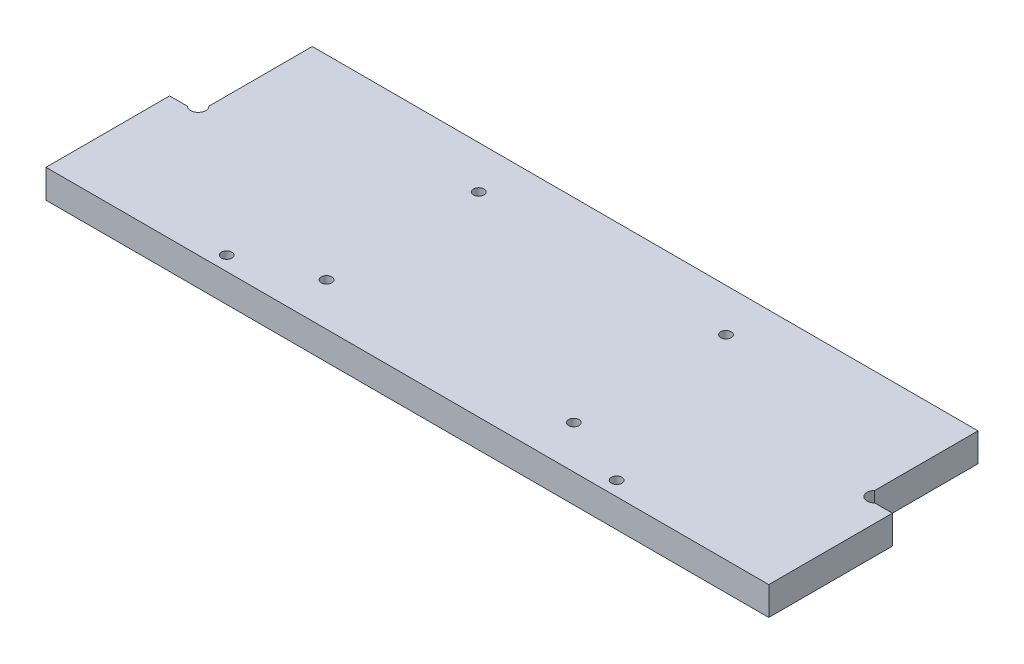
ISO-10303-21;
HEADER;
FILE_DESCRIPTION(('STEP AP214'),'2;1');
FILE_NAME('part.step','',(''),(''),'','','');
FILE_SCHEMA(('AUTOMOTIVE_DESIGN { 1 0 10303 214 1 1 1 1 }'));
ENDSEC;
DATA;
#1=APPLICATION_CONTEXT('core data for automotive mechanical design processes');
#2=APPLICATION_PROTOCOL_DEFINITION('international standard','automotive_design',2000,#1);
#3=PRODUCT_CONTEXT('',#1,'mechanical');
#4=PRODUCT('Part','Part','',(#3));
#5=PRODUCT_RELATED_PRODUCT_CATEGORY('part','',(#4));
#6=PRODUCT_DEFINITION_FORMATION('','',#4);
#7=PRODUCT_DEFINITION_CONTEXT('part definition',#1,'design');
#8=PRODUCT_DEFINITION('design','',#6,#7);
#9=PRODUCT_DEFINITION_SHAPE('','',#8);
#10=(LENGTH_UNIT() NAMED_UNIT(*) SI_UNIT(.MILLI.,.METRE.));
#11=(NAMED_UNIT(*) PLANE_ANGLE_UNIT() SI_UNIT($,.RADIAN.));
#12=(NAMED_UNIT(*) SI_UNIT($,.STERADIAN.) SOLID_ANGLE_UNIT());
#13=UNCERTAINTY_MEASURE_WITH_UNIT(LENGTH_MEASURE(1.E-05),#10,'distance_accuracy_value','');
#14=(GEOMETRIC_REPRESENTATION_CONTEXT(3) GLOBAL_UNCERTAINTY_ASSIGNED_CONTEXT((#13)) GLOBAL_UNIT_ASSIGNED_CONTEXT((#10,
#11,#12)) REPRESENTATION_CONTEXT('',''));
#15=CARTESIAN_POINT('',(0.,0.,0.));
#16=DIRECTION('',(0.,0.,1.));
#17=DIRECTION('',(1.,0.,0.));
#18=AXIS2_PLACEMENT_3D('',#15,#16,#17);
#19=CARTESIAN_POINT('',(147.131370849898,6.,-27.1313708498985));
#20=DIRECTION('',(0.,1.,0.));
#21=DIRECTION('',(0.,0.,1.));
#22=AXIS2_PLACEMENT_3D('',#19,#20,#21);
#23=PLANE('',#22);
#24=CARTESIAN_POINT('',(102.,6.,-41.));
#25=DIRECTION('',(0.,1.,0.));
#26=DIRECTION('',(0.,0.,1.));
#27=AXIS2_PLACEMENT_3D('',#24,#25,#26);
#28=CIRCLE('',#27,1.09999999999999);
#29=CARTESIAN_POINT('',(102.,6.,-39.9));
#30=VERTEX_POINT('',#29);
#31=EDGE_CURVE('E230',#30,#30,#28,.T.);
#32=ORIENTED_EDGE('',*,*,#31,.F.);
#33=EDGE_LOOP('',(#32));
#34=FACE_BOUND('',#33,.T.);
#35=CARTESIAN_POINT('',(50.,6.,-9.00000000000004));
#36=DIRECTION('',(0.,1.,0.));
#37=DIRECTION('',(0.,0.,1.));
#38=AXIS2_PLACEMENT_3D('',#35,#36,#37);
#39=CIRCLE('',#38,1.1);
#40=CARTESIAN_POINT('',(50.,6.,-7.90000000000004));
#41=VERTEX_POINT('',#40);
#42=EDGE_CURVE('E218',#41,#41,#39,.T.);
#43=ORIENTED_EDGE('',*,*,#42,.F.);
#44=EDGE_LOOP('',(#43));
#45=FACE_BOUND('',#44,.T.);
#46=CARTESIAN_POINT('',(117.,6.,-3.));
#47=DIRECTION('',(0.,1.,0.));
#48=DIRECTION('',(0.,0.,1.));
#49=AXIS2_PLACEMENT_3D('',#46,#47,#48);
#50=CIRCLE('',#49,1.10000000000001);
#51=CARTESIAN_POINT('',(117.,6.,-1.89999999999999));
#52=VERTEX_POINT('',#51);
#53=EDGE_CURVE('E146',#52,#52,#50,.T.);
#54=ORIENTED_EDGE('',*,*,#53,.F.);
#55=EDGE_LOOP('',(#54));
#56=FACE_BOUND('',#55,.T.);
#57=CARTESIAN_POINT('',(147.131370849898,6.,-27.1313708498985));
#58=DIRECTION('',(0.,-1.,0.));
#59=DIRECTION('',(0.,0.,1.));
#60=AXIS2_PLACEMENT_3D('',#57,#58,#59);
#61=CIRCLE('',#60,1.59999999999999);
#62=CARTESIAN_POINT('',(148.262741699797,6.,-26.));
#63=VERTEX_POINT('',#62);
#64=CARTESIAN_POINT('',(146.,6.,-28.2627416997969));
#65=VERTEX_POINT('',#64);
#66=EDGE_CURVE('E161',#63,#65,#61,.T.);
#67=ORIENTED_EDGE('',*,*,#66,.T.);
#68=DIRECTION('',(0.,0.,-1.));
#69=VECTOR('',#68,1.);
#70=CARTESIAN_POINT('',(146.,6.,-28.2627416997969));
#71=LINE('',#70,#69);
#72=CARTESIAN_POINT('',(146.,6.,-50.));
#73=VERTEX_POINT('',#72);
#74=EDGE_CURVE('E99',#65,#73,#71,.T.);
#75=ORIENTED_EDGE('',*,*,#74,.T.);
#76=DIRECTION('',(-1.,0.,0.));
#77=VECTOR('',#76,1.);
#78=CARTESIAN_POINT('',(6.00000000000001,6.,-50.));
#79=LINE('',#78,#77);
#80=CARTESIAN_POINT('',(6.00000000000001,6.,-50.));
#81=VERTEX_POINT('',#80);
#82=EDGE_CURVE('E182',#73,#81,#79,.T.);
#83=ORIENTED_EDGE('',*,*,#82,.T.);
#84=DIRECTION('',(0.,0.,1.));
#85=VECTOR('',#84,1.);
#86=CARTESIAN_POINT('',(6.00000000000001,6.,-28.2627416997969));
#87=LINE('',#86,#85);
#88=CARTESIAN_POINT('',(6.00000000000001,6.,-28.2627416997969));
#89=VERTEX_POINT('',#88);
#90=EDGE_CURVE('E201',#81,#89,#87,.T.);
#91=ORIENTED_EDGE('',*,*,#90,.T.);
#92=CARTESIAN_POINT('',(4.86862915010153,6.,-27.1313708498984));
#93=DIRECTION('',(0.,-1.,0.));
#94=DIRECTION('',(0.,0.,-1.));
#95=AXIS2_PLACEMENT_3D('',#92,#93,#94);
#96=CIRCLE('',#95,1.6);
#97=CARTESIAN_POINT('',(3.73725830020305,6.,-26.));
#98=VERTEX_POINT('',#97);
#99=EDGE_CURVE('E198',#89,#98,#96,.T.);
#100=ORIENTED_EDGE('',*,*,#99,.T.);
#101=DIRECTION('',(-1.,0.,0.));
#102=VECTOR('',#101,1.);
#103=CARTESIAN_POINT('',(3.73725830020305,6.,-26.));
#104=LINE('',#103,#102);
#105=CARTESIAN_POINT('',(0.,6.,-26.));
#106=VERTEX_POINT('',#105);
#107=EDGE_CURVE('E200',#98,#106,#104,.T.);
#108=ORIENTED_EDGE('',*,*,#107,.T.);
#109=DIRECTION('',(0.,0.,1.));
#110=VECTOR('',#109,1.);
#111=CARTESIAN_POINT('',(0.,6.,-26.));
#112=LINE('',#111,#110);
#113=CARTESIAN_POINT('',(0.,6.,0.));
#114=VERTEX_POINT('',#113);
#115=EDGE_CURVE('E124',#106,#114,#112,.T.);
#116=ORIENTED_EDGE('',*,*,#115,.T.);
#117=DIRECTION('',(1.,0.,0.));
#118=VECTOR('',#117,1.);
#119=CARTESIAN_POINT('',(0.,6.,0.));
#120=LINE('',#119,#118);
#121=CARTESIAN_POINT('',(152.,6.,0.));
#122=VERTEX_POINT('',#121);
#123=EDGE_CURVE('E118',#114,#122,#120,.T.);
#124=ORIENTED_EDGE('',*,*,#123,.T.);
#125=DIRECTION('',(0.,0.,-1.));
#126=VECTOR('',#125,1.);
#127=CARTESIAN_POINT('',(152.,6.,-26.));
#128=LINE('',#127,#126);
#129=CARTESIAN_POINT('',(152.,6.,-26.));
#130=VERTEX_POINT('',#129);
#131=EDGE_CURVE('E122',#122,#130,#128,.T.);
#132=ORIENTED_EDGE('',*,*,#131,.T.);
#133=DIRECTION('',(-1.,0.,0.));
#134=VECTOR('',#133,1.);
#135=CARTESIAN_POINT('',(148.262741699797,6.,-26.));
#136=LINE('',#135,#134);
#137=EDGE_CURVE('E50',#130,#63,#136,.T.);
#138=ORIENTED_EDGE('',*,*,#137,.T.);
#139=EDGE_LOOP('',(#67,#75,#83,#91,#100,#108,#116,#124,#132,#138));
#140=FACE_BOUND('',#139,.T.);
#141=CARTESIAN_POINT('',(35.,6.,-2.99999999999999));
#142=DIRECTION('',(0.,1.,0.));
#143=DIRECTION('',(0.,0.,-1.));
#144=AXIS2_PLACEMENT_3D('',#141,#142,#143);
#145=CIRCLE('',#144,1.10000000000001);
#146=CARTESIAN_POINT('',(35.,6.,-4.09999999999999));
#147=VERTEX_POINT('',#146);
#148=EDGE_CURVE('E212',#147,#147,#145,.T.);
#149=ORIENTED_EDGE('',*,*,#148,.F.);
#150=EDGE_LOOP('',(#149));
#151=FACE_BOUND('',#150,.T.);
#152=CARTESIAN_POINT('',(102.,6.,-9.00000000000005));
#153=DIRECTION('',(0.,1.,0.));
#154=DIRECTION('',(0.,0.,-1.));
#155=AXIS2_PLACEMENT_3D('',#152,#153,#154);
#156=CIRCLE('',#155,1.09999999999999);
#157=CARTESIAN_POINT('',(102.,6.,-10.1));
#158=VERTEX_POINT('',#157);
#159=EDGE_CURVE('E224',#158,#158,#156,.T.);
#160=ORIENTED_EDGE('',*,*,#159,.F.);
#161=EDGE_LOOP('',(#160));
#162=FACE_BOUND('',#161,.T.);
#163=CARTESIAN_POINT('',(50.,6.,-41.));
#164=DIRECTION('',(0.,1.,0.));
#165=DIRECTION('',(0.,0.,-1.));
#166=AXIS2_PLACEMENT_3D('',#163,#164,#165);
#167=CIRCLE('',#166,1.1);
#168=CARTESIAN_POINT('',(50.,6.,-42.1));
#169=VERTEX_POINT('',#168);
#170=EDGE_CURVE('E236',#169,#169,#167,.T.);
#171=ORIENTED_EDGE('',*,*,#170,.F.);
#172=EDGE_LOOP('',(#171));
#173=FACE_BOUND('',#172,.T.);
#174=ADVANCED_FACE('F33',(#34,#45,#56,#140,#151,#162,#173),#23,.T.);
#175=CARTESIAN_POINT('',(147.131370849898,0.,-27.1313708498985));
#176=DIRECTION('',(0.,1.,0.));
#177=DIRECTION('',(0.,0.,1.));
#178=AXIS2_PLACEMENT_3D('',#175,#176,#177);
#179=PLANE('',#178);
#180=CARTESIAN_POINT('',(147.131370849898,0.,-27.1313708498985));
#181=DIRECTION('',(0.,-1.,0.));
#182=DIRECTION('',(0.,0.,1.));
#183=AXIS2_PLACEMENT_3D('',#180,#181,#182);
#184=CIRCLE('',#183,1.59999999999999);
#185=CARTESIAN_POINT('',(148.262741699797,0.,-26.));
#186=VERTEX_POINT('',#185);
#187=CARTESIAN_POINT('',(146.,0.,-28.2627416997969));
#188=VERTEX_POINT('',#187);
#189=EDGE_CURVE('E142',#186,#188,#184,.T.);
#190=ORIENTED_EDGE('',*,*,#189,.F.);
#191=DIRECTION('',(-1.,0.,0.));
#192=VECTOR('',#191,1.);
#193=CARTESIAN_POINT('',(148.262741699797,0.,-26.));
#194=LINE('',#193,#192);
#195=CARTESIAN_POINT('',(152.,0.,-26.));
#196=VERTEX_POINT('',#195);
#197=EDGE_CURVE('E91',#196,#186,#194,.T.);
#198=ORIENTED_EDGE('',*,*,#197,.F.);
#199=DIRECTION('',(0.,0.,-1.));
#200=VECTOR('',#199,1.);
#201=CARTESIAN_POINT('',(152.,0.,-26.));
#202=LINE('',#201,#200);
#203=CARTESIAN_POINT('',(152.,0.,0.));
#204=VERTEX_POINT('',#203);
#205=EDGE_CURVE('E85',#204,#196,#202,.T.);
#206=ORIENTED_EDGE('',*,*,#205,.F.);
#207=DIRECTION('',(1.,0.,0.));
#208=VECTOR('',#207,1.);
#209=CARTESIAN_POINT('',(0.,0.,0.));
#210=LINE('',#209,#208);
#211=CARTESIAN_POINT('',(0.,0.,0.));
#212=VERTEX_POINT('',#211);
#213=EDGE_CURVE('E132',#212,#204,#210,.T.);
#214=ORIENTED_EDGE('',*,*,#213,.F.);
#215=DIRECTION('',(0.,0.,1.));
#216=VECTOR('',#215,1.);
#217=CARTESIAN_POINT('',(0.,0.,-26.));
#218=LINE('',#217,#216);
#219=CARTESIAN_POINT('',(0.,0.,-26.));
#220=VERTEX_POINT('',#219);
#221=EDGE_CURVE('E156',#220,#212,#218,.T.);
#222=ORIENTED_EDGE('',*,*,#221,.F.);
#223=DIRECTION('',(-1.,0.,0.));
#224=VECTOR('',#223,1.);
#225=CARTESIAN_POINT('',(3.73725830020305,0.,-26.));
#226=LINE('',#225,#224);
#227=CARTESIAN_POINT('',(3.73725830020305,0.,-26.));
#228=VERTEX_POINT('',#227);
#229=EDGE_CURVE('E154',#228,#220,#226,.T.);
#230=ORIENTED_EDGE('',*,*,#229,.F.);
#231=CARTESIAN_POINT('',(4.86862915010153,0.,-27.1313708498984));
#232=DIRECTION('',(0.,-1.,0.));
#233=DIRECTION('',(0.,0.,-1.));
#234=AXIS2_PLACEMENT_3D('',#231,#232,#233);
#235=CIRCLE('',#234,1.6);
#236=CARTESIAN_POINT('',(6.00000000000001,0.,-28.2627416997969));
#237=VERTEX_POINT('',#236);
#238=EDGE_CURVE('E152',#237,#228,#235,.T.);
#239=ORIENTED_EDGE('',*,*,#238,.F.);
#240=DIRECTION('',(0.,0.,1.));
#241=VECTOR('',#240,1.);
#242=CARTESIAN_POINT('',(6.00000000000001,0.,-28.2627416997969));
#243=LINE('',#242,#241);
#244=CARTESIAN_POINT('',(6.00000000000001,0.,-50.));
#245=VERTEX_POINT('',#244);
#246=EDGE_CURVE('E150',#245,#237,#243,.T.);
#247=ORIENTED_EDGE('',*,*,#246,.F.);
#248=DIRECTION('',(-1.,0.,0.));
#249=VECTOR('',#248,1.);
#250=CARTESIAN_POINT('',(6.00000000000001,0.,-50.));
#251=LINE('',#250,#249);
#252=CARTESIAN_POINT('',(146.,0.,-50.));
#253=VERTEX_POINT('',#252);
#254=EDGE_CURVE('E148',#253,#245,#251,.T.);
#255=ORIENTED_EDGE('',*,*,#254,.F.);
#256=DIRECTION('',(0.,0.,-1.));
#257=VECTOR('',#256,1.);
#258=CARTESIAN_POINT('',(146.,0.,-28.2627416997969));
#259=LINE('',#258,#257);
#260=EDGE_CURVE('E145',#188,#253,#259,.T.);
#261=ORIENTED_EDGE('',*,*,#260,.F.);
#262=EDGE_LOOP('',(#190,#198,#206,#214,#222,#230,#239,#247,#255,#261));
#263=FACE_BOUND('',#262,.T.);
#264=CARTESIAN_POINT('',(117.,0.,-3.));
#265=DIRECTION('',(0.,1.,0.));
#266=DIRECTION('',(0.,0.,1.));
#267=AXIS2_PLACEMENT_3D('',#264,#265,#266);
#268=CIRCLE('',#267,1.10000000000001);
#269=CARTESIAN_POINT('',(117.,0.,-1.89999999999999));
#270=VERTEX_POINT('',#269);
#271=EDGE_CURVE('E209',#270,#270,#268,.T.);
#272=ORIENTED_EDGE('',*,*,#271,.T.);
#273=EDGE_LOOP('',(#272));
#274=FACE_BOUND('',#273,.T.);
#275=CARTESIAN_POINT('',(35.,0.,-2.99999999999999));
#276=DIRECTION('',(0.,1.,0.));
#277=DIRECTION('',(0.,0.,-1.));
#278=AXIS2_PLACEMENT_3D('',#275,#276,#277);
#279=CIRCLE('',#278,1.10000000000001);
#280=CARTESIAN_POINT('',(35.,0.,-4.09999999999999));
#281=VERTEX_POINT('',#280);
#282=EDGE_CURVE('E215',#281,#281,#279,.T.);
#283=ORIENTED_EDGE('',*,*,#282,.T.);
#284=EDGE_LOOP('',(#283));
#285=FACE_BOUND('',#284,.T.);
#286=CARTESIAN_POINT('',(50.,0.,-9.00000000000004));
#287=DIRECTION('',(0.,1.,0.));
#288=DIRECTION('',(0.,0.,1.));
#289=AXIS2_PLACEMENT_3D('',#286,#287,#288);
#290=CIRCLE('',#289,1.1);
#291=CARTESIAN_POINT('',(50.,0.,-7.90000000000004));
#292=VERTEX_POINT('',#291);
#293=EDGE_CURVE('E221',#292,#292,#290,.T.);
#294=ORIENTED_EDGE('',*,*,#293,.T.);
#295=EDGE_LOOP('',(#294));
#296=FACE_BOUND('',#295,.T.);
#297=CARTESIAN_POINT('',(102.,0.,-9.00000000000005));
#298=DIRECTION('',(0.,1.,0.));
#299=DIRECTION('',(0.,0.,-1.));
#300=AXIS2_PLACEMENT_3D('',#297,#298,#299);
#301=CIRCLE('',#300,1.09999999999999);
#302=CARTESIAN_POINT('',(102.,0.,-10.1));
#303=VERTEX_POINT('',#302);
#304=EDGE_CURVE('E227',#303,#303,#301,.T.);
#305=ORIENTED_EDGE('',*,*,#304,.T.);
#306=EDGE_LOOP('',(#305));
#307=FACE_BOUND('',#306,.T.);
#308=CARTESIAN_POINT('',(102.,0.,-41.));
#309=DIRECTION('',(0.,1.,0.));
#310=DIRECTION('',(0.,0.,1.));
#311=AXIS2_PLACEMENT_3D('',#308,#309,#310);
#312=CIRCLE('',#311,1.09999999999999);
#313=CARTESIAN_POINT('',(102.,0.,-39.9));
#314=VERTEX_POINT('',#313);
#315=EDGE_CURVE('E233',#314,#314,#312,.T.);
#316=ORIENTED_EDGE('',*,*,#315,.T.);
#317=EDGE_LOOP('',(#316));
#318=FACE_BOUND('',#317,.T.);
#319=CARTESIAN_POINT('',(50.,0.,-41.));
#320=DIRECTION('',(0.,1.,0.));
#321=DIRECTION('',(0.,0.,-1.));
#322=AXIS2_PLACEMENT_3D('',#319,#320,#321);
#323=CIRCLE('',#322,1.1);
#324=CARTESIAN_POINT('',(50.,0.,-42.1));
#325=VERTEX_POINT('',#324);
#326=EDGE_CURVE('E239',#325,#325,#323,.T.);
#327=ORIENTED_EDGE('',*,*,#326,.T.);
#328=EDGE_LOOP('',(#327));
#329=FACE_BOUND('',#328,.T.);
#330=ADVANCED_FACE('F186',(#263,#274,#285,#296,#307,#318,#329),#179,.F.);
#331=CARTESIAN_POINT('',(147.131370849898,6.,-27.1313708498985));
#332=DIRECTION('',(0.,-1.,0.));
#333=DIRECTION('',(0.,0.,-1.));
#334=AXIS2_PLACEMENT_3D('',#331,#332,#333);
#335=CYLINDRICAL_SURFACE('',#334,1.59999999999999);
#336=ORIENTED_EDGE('',*,*,#189,.T.);
#337=DIRECTION('',(0.,-1.,0.));
#338=VECTOR('',#337,1.);
#339=CARTESIAN_POINT('',(146.,6.,-28.2627416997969));
#340=LINE('',#339,#338);
#341=EDGE_CURVE('E11',#65,#188,#340,.T.);
#342=ORIENTED_EDGE('',*,*,#341,.F.);
#343=ORIENTED_EDGE('',*,*,#66,.F.);
#344=DIRECTION('',(0.,-1.,0.));
#345=VECTOR('',#344,1.);
#346=CARTESIAN_POINT('',(148.262741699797,6.,-26.));
#347=LINE('',#346,#345);
#348=EDGE_CURVE('E138',#63,#186,#347,.T.);
#349=ORIENTED_EDGE('',*,*,#348,.T.);
#350=EDGE_LOOP('',(#336,#342,#343,#349));
#351=FACE_BOUND('',#350,.T.);
#352=ADVANCED_FACE('F35',(#351),#335,.F.);
#353=CARTESIAN_POINT('',(146.,6.,-28.2627416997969));
#354=DIRECTION('',(-1.,0.,0.));
#355=DIRECTION('',(0.,0.,1.));
#356=AXIS2_PLACEMENT_3D('',#353,#354,#355);
#357=PLANE('',#356);
#358=ORIENTED_EDGE('',*,*,#260,.T.);
#359=DIRECTION('',(0.,-1.,0.));
#360=VECTOR('',#359,1.);
#361=CARTESIAN_POINT('',(146.,6.,-50.));
#362=LINE('',#361,#360);
#363=EDGE_CURVE('E42',#73,#253,#362,.T.);
#364=ORIENTED_EDGE('',*,*,#363,.F.);
#365=ORIENTED_EDGE('',*,*,#74,.F.);
#366=ORIENTED_EDGE('',*,*,#341,.T.);
#367=EDGE_LOOP('',(#358,#364,#365,#366));
#368=FACE_BOUND('',#367,.T.);
#369=ADVANCED_FACE('F281',(#368),#357,.F.);
#370=CARTESIAN_POINT('',(6.00000000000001,6.,-50.));
#371=DIRECTION('',(0.,0.,1.));
#372=DIRECTION('',(1.,0.,0.));
#373=AXIS2_PLACEMENT_3D('',#370,#371,#372);
#374=PLANE('',#373);
#375=ORIENTED_EDGE('',*,*,#254,.T.);
#376=DIRECTION('',(0.,-1.,0.));
#377=VECTOR('',#376,1.);
#378=CARTESIAN_POINT('',(6.00000000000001,6.,-50.));
#379=LINE('',#378,#377);
#380=EDGE_CURVE('E174',#81,#245,#379,.T.);
#381=ORIENTED_EDGE('',*,*,#380,.F.);
#382=ORIENTED_EDGE('',*,*,#82,.F.);
#383=ORIENTED_EDGE('',*,*,#363,.T.);
#384=EDGE_LOOP('',(#375,#381,#382,#383));
#385=FACE_BOUND('',#384,.T.);
#386=ADVANCED_FACE('F180',(#385),#374,.F.);
#387=CARTESIAN_POINT('',(6.00000000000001,6.,-28.2627416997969));
#388=DIRECTION('',(1.,0.,0.));
#389=DIRECTION('',(0.,0.,-1.));
#390=AXIS2_PLACEMENT_3D('',#387,#388,#389);
#391=PLANE('',#390);
#392=ORIENTED_EDGE('',*,*,#246,.T.);
#393=DIRECTION('',(0.,-1.,0.));
#394=VECTOR('',#393,1.);
#395=CARTESIAN_POINT('',(6.00000000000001,6.,-28.2627416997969));
#396=LINE('',#395,#394);
#397=EDGE_CURVE('E171',#89,#237,#396,.T.);
#398=ORIENTED_EDGE('',*,*,#397,.F.);
#399=ORIENTED_EDGE('',*,*,#90,.F.);
#400=ORIENTED_EDGE('',*,*,#380,.T.);
#401=EDGE_LOOP('',(#392,#398,#399,#400));
#402=FACE_BOUND('',#401,.T.);
#403=ADVANCED_FACE('F192',(#402),#391,.F.);
#404=CARTESIAN_POINT('',(4.86862915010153,6.,-27.1313708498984));
#405=DIRECTION('',(0.,-1.,0.));
#406=DIRECTION('',(0.,0.,-1.));
#407=AXIS2_PLACEMENT_3D('',#404,#405,#406);
#408=CYLINDRICAL_SURFACE('',#407,1.6);
#409=ORIENTED_EDGE('',*,*,#238,.T.);
#410=DIRECTION('',(0.,-1.,0.));
#411=VECTOR('',#410,1.);
#412=CARTESIAN_POINT('',(3.73725830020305,6.,-26.));
#413=LINE('',#412,#411);
#414=EDGE_CURVE('E168',#98,#228,#413,.T.);
#415=ORIENTED_EDGE('',*,*,#414,.F.);
#416=ORIENTED_EDGE('',*,*,#99,.F.);
#417=ORIENTED_EDGE('',*,*,#397,.T.);
#418=EDGE_LOOP('',(#409,#415,#416,#417));
#419=FACE_BOUND('',#418,.T.);
#420=ADVANCED_FACE('F196',(#419),#408,.F.);
#421=CARTESIAN_POINT('',(3.73725830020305,6.,-26.));
#422=DIRECTION('',(0.,0.,1.));
#423=DIRECTION('',(1.,0.,0.));
#424=AXIS2_PLACEMENT_3D('',#421,#422,#423);
#425=PLANE('',#424);
#426=ORIENTED_EDGE('',*,*,#229,.T.);
#427=DIRECTION('',(0.,-1.,0.));
#428=VECTOR('',#427,1.);
#429=CARTESIAN_POINT('',(0.,6.,-26.));
#430=LINE('',#429,#428);
#431=EDGE_CURVE('E165',#106,#220,#430,.T.);
#432=ORIENTED_EDGE('',*,*,#431,.F.);
#433=ORIENTED_EDGE('',*,*,#107,.F.);
#434=ORIENTED_EDGE('',*,*,#414,.T.);
#435=EDGE_LOOP('',(#426,#432,#433,#434));
#436=FACE_BOUND('',#435,.T.);
#437=ADVANCED_FACE('F271',(#436),#425,.F.);
#438=CARTESIAN_POINT('',(0.,6.,-26.));
#439=DIRECTION('',(1.,0.,0.));
#440=DIRECTION('',(0.,0.,-1.));
#441=AXIS2_PLACEMENT_3D('',#438,#439,#440);
#442=PLANE('',#441);
#443=ORIENTED_EDGE('',*,*,#221,.T.);
#444=DIRECTION('',(0.,-1.,0.));
#445=VECTOR('',#444,1.);
#446=CARTESIAN_POINT('',(0.,6.,0.));
#447=LINE('',#446,#445);
#448=EDGE_CURVE('E133',#114,#212,#447,.T.);
#449=ORIENTED_EDGE('',*,*,#448,.F.);
#450=ORIENTED_EDGE('',*,*,#115,.F.);
#451=ORIENTED_EDGE('',*,*,#431,.T.);
#452=EDGE_LOOP('',(#443,#449,#450,#451));
#453=FACE_BOUND('',#452,.T.);
#454=ADVANCED_FACE('F268',(#453),#442,.F.);
#455=CARTESIAN_POINT('',(0.,6.,0.));
#456=DIRECTION('',(0.,0.,-1.));
#457=DIRECTION('',(-1.,0.,0.));
#458=AXIS2_PLACEMENT_3D('',#455,#456,#457);
#459=PLANE('',#458);
#460=ORIENTED_EDGE('',*,*,#213,.T.);
#461=DIRECTION('',(0.,-1.,0.));
#462=VECTOR('',#461,1.);
#463=CARTESIAN_POINT('',(152.,6.,0.));
#464=LINE('',#463,#462);
#465=EDGE_CURVE('E129',#122,#204,#464,.T.);
#466=ORIENTED_EDGE('',*,*,#465,.F.);
#467=ORIENTED_EDGE('',*,*,#123,.F.);
#468=ORIENTED_EDGE('',*,*,#448,.T.);
#469=EDGE_LOOP('',(#460,#466,#467,#468));
#470=FACE_BOUND('',#469,.T.);
#471=ADVANCED_FACE('F130',(#470),#459,.F.);
#472=CARTESIAN_POINT('',(152.,6.,-26.));
#473=DIRECTION('',(-1.,0.,0.));
#474=DIRECTION('',(0.,0.,1.));
#475=AXIS2_PLACEMENT_3D('',#472,#473,#474);
#476=PLANE('',#475);
#477=ORIENTED_EDGE('',*,*,#205,.T.);
#478=DIRECTION('',(0.,-1.,0.));
#479=VECTOR('',#478,1.);
#480=CARTESIAN_POINT('',(152.,6.,-26.));
#481=LINE('',#480,#479);
#482=EDGE_CURVE('E134',#130,#196,#481,.T.);
#483=ORIENTED_EDGE('',*,*,#482,.F.);
#484=ORIENTED_EDGE('',*,*,#131,.F.);
#485=ORIENTED_EDGE('',*,*,#465,.T.);
#486=EDGE_LOOP('',(#477,#483,#484,#485));
#487=FACE_BOUND('',#486,.T.);
#488=ADVANCED_FACE('F136',(#487),#476,.F.);
#489=CARTESIAN_POINT('',(148.262741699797,6.,-26.));
#490=DIRECTION('',(0.,0.,1.));
#491=DIRECTION('',(1.,0.,0.));
#492=AXIS2_PLACEMENT_3D('',#489,#490,#491);
#493=PLANE('',#492);
#494=ORIENTED_EDGE('',*,*,#197,.T.);
#495=ORIENTED_EDGE('',*,*,#348,.F.);
#496=ORIENTED_EDGE('',*,*,#137,.F.);
#497=ORIENTED_EDGE('',*,*,#482,.T.);
#498=EDGE_LOOP('',(#494,#495,#496,#497));
#499=FACE_BOUND('',#498,.T.);
#500=ADVANCED_FACE('F261',(#499),#493,.F.);
#501=CARTESIAN_POINT('',(117.,6.,-3.));
#502=DIRECTION('',(0.,-1.,0.));
#503=DIRECTION('',(0.,0.,-1.));
#504=AXIS2_PLACEMENT_3D('',#501,#502,#503);
#505=CYLINDRICAL_SURFACE('',#504,1.10000000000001);
#506=ORIENTED_EDGE('',*,*,#53,.T.);
#507=EDGE_LOOP('',(#506));
#508=FACE_BOUND('',#507,.T.);
#509=ORIENTED_EDGE('',*,*,#271,.F.);
#510=EDGE_LOOP('',(#509));
#511=FACE_BOUND('',#510,.T.);
#512=ADVANCED_FACE('F258',(#508,#511),#505,.F.);
#513=CARTESIAN_POINT('',(35.,6.,-2.99999999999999));
#514=DIRECTION('',(0.,-1.,0.));
#515=DIRECTION('',(0.,0.,-1.));
#516=AXIS2_PLACEMENT_3D('',#513,#514,#515);
#517=CYLINDRICAL_SURFACE('',#516,1.10000000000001);
#518=ORIENTED_EDGE('',*,*,#148,.T.);
#519=EDGE_LOOP('',(#518));
#520=FACE_BOUND('',#519,.T.);
#521=ORIENTED_EDGE('',*,*,#282,.F.);
#522=EDGE_LOOP('',(#521));
#523=FACE_BOUND('',#522,.T.);
#524=ADVANCED_FACE('F357',(#520,#523),#517,.F.);
#525=CARTESIAN_POINT('',(50.,6.,-9.00000000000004));
#526=DIRECTION('',(0.,-1.,0.));
#527=DIRECTION('',(0.,0.,-1.));
#528=AXIS2_PLACEMENT_3D('',#525,#526,#527);
#529=CYLINDRICAL_SURFACE('',#528,1.1);
#530=ORIENTED_EDGE('',*,*,#42,.T.);
#531=EDGE_LOOP('',(#530));
#532=FACE_BOUND('',#531,.T.);
#533=ORIENTED_EDGE('',*,*,#293,.F.);
#534=EDGE_LOOP('',(#533));
#535=FACE_BOUND('',#534,.T.);
#536=ADVANCED_FACE('F365',(#532,#535),#529,.F.);
#537=CARTESIAN_POINT('',(102.,6.,-9.00000000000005));
#538=DIRECTION('',(0.,-1.,0.));
#539=DIRECTION('',(0.,0.,-1.));
#540=AXIS2_PLACEMENT_3D('',#537,#538,#539);
#541=CYLINDRICAL_SURFACE('',#540,1.09999999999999);
#542=ORIENTED_EDGE('',*,*,#159,.T.);
#543=EDGE_LOOP('',(#542));
#544=FACE_BOUND('',#543,.T.);
#545=ORIENTED_EDGE('',*,*,#304,.F.);
#546=EDGE_LOOP('',(#545));
#547=FACE_BOUND('',#546,.T.);
#548=ADVANCED_FACE('F373',(#544,#547),#541,.F.);
#549=CARTESIAN_POINT('',(102.,6.,-41.));
#550=DIRECTION('',(0.,-1.,0.));
#551=DIRECTION('',(0.,0.,-1.));
#552=AXIS2_PLACEMENT_3D('',#549,#550,#551);
#553=CYLINDRICAL_SURFACE('',#552,1.09999999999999);
#554=ORIENTED_EDGE('',*,*,#31,.T.);
#555=EDGE_LOOP('',(#554));
#556=FACE_BOUND('',#555,.T.);
#557=ORIENTED_EDGE('',*,*,#315,.F.);
#558=EDGE_LOOP('',(#557));
#559=FACE_BOUND('',#558,.T.);
#560=ADVANCED_FACE('F382',(#556,#559),#553,.F.);
#561=CARTESIAN_POINT('',(50.,6.,-41.));
#562=DIRECTION('',(0.,-1.,0.));
#563=DIRECTION('',(0.,0.,-1.));
#564=AXIS2_PLACEMENT_3D('',#561,#562,#563);
#565=CYLINDRICAL_SURFACE('',#564,1.1);
#566=ORIENTED_EDGE('',*,*,#170,.T.);
#567=EDGE_LOOP('',(#566));
#568=FACE_BOUND('',#567,.T.);
#569=ORIENTED_EDGE('',*,*,#326,.F.);
#570=EDGE_LOOP('',(#569));
#571=FACE_BOUND('',#570,.T.);
#572=ADVANCED_FACE('F245',(#568,#571),#565,.F.);
#573=CLOSED_SHELL('',(#174,#330,#352,#369,#386,#403,#420,#437,#454,#471,#488,#500,#512,#524,
#536,#548,#560,#572));
#574=MANIFOLD_SOLID_BREP('B2',#573);
#575=ADVANCED_BREP_SHAPE_REPRESENTATION('',(#18,#574),#14);
#576=SHAPE_DEFINITION_REPRESENTATION(#9,#575);
ENDSEC;
END-ISO-10303-21;
